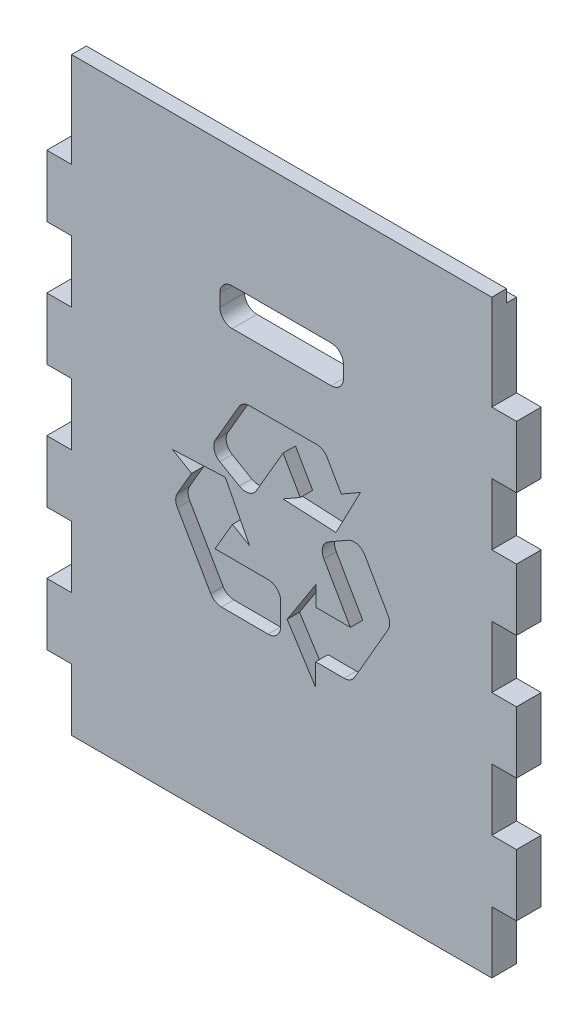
from build123d import *

# Parameters (mm, degrees)
EXTRUDE1_DEPTH = 20
EXTRUDE2_DEPTH = 611.187676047
EXTRUDE3_DEPTH = 10
SKETCH4_W      = 340
SKETCH4_H      = 10
EXTRUDE4_DEPTH = 8


with BuildPart() as part:
    # Sketch1 → Extrude1 (new body)
    with BuildSketch(Plane.XY):
        Polygon((0, 50), (20, 50), (20, 0), (360, 0), (360, 50), (380, 50), (380, 100), (360, 100), (360, 150), (380, 150), (380, 200), (360, 200), (360, 250), (380, 250), (380, 300), (360, 300), (360, 350), (380, 350), (380, 400), (360, 400), (360, 477), (20, 477), (20, 400), (0, 400), (0, 350), (20, 350), (20, 300), (0, 300), (0, 250), (20, 250), (20, 200), (0, 200), (0, 150), (20, 150), (20, 100), (0, 100), align=None)
    extrude(amount=EXTRUDE1_DEPTH)

    # Sketch2 → Extrude2 (cut, through all)
    with BuildSketch(Plane.XY.offset(20)):
        with BuildLine():
            Line((150, 380), (230, 380))
            ThreePointArc((230, 380), (237.071067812, 377.071067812), (240, 370))
            Line((240, 370), (240, 360))
            ThreePointArc((240, 360), (237.071067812, 352.928932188), (230, 350))
            Line((230, 350), (150, 350))
            ThreePointArc((150, 350), (142.928932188, 352.928932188), (140, 360))
            Line((140, 360), (140, 370))
            ThreePointArc((140, 370), (142.928932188, 377.071067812), (150, 380))
        make_face()
    extrude(amount=-EXTRUDE2_DEPTH, mode=Mode.SUBTRACT)

    # Sketch3 → Extrude3 (cut)
    with BuildSketch(Plane.XY.offset(20)):
        with BuildLine():
            Line((164.11707753, 303.028192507), (218.213802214, 303.028192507))
            ThreePointArc((218.213802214, 303.028192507), (223.228306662, 301.680056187), (226.890763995, 297.999141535))
            Line((226.890763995, 297.999141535), (238.231946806, 278.202718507))
            Line((238.231946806, 278.202718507), (253.787861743, 287.114554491))
            Line((253.787861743, 287.114554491), (233.97327242, 249.093892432))
            Line((233.97327242, 249.093892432), (191.152482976, 251.231340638))
            Line((191.152482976, 251.231340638), (205.052520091, 259.194539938))
            Line((205.052520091, 259.194539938), (191.185507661, 283.399885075))
            Line((191.185507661, 283.399885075), (169.517495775, 246.158574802))
            ThreePointArc((169.517495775, 246.158574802), (163.429851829, 241.51969186), (155.845051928, 242.544120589))
            Line((155.845051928, 242.544120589), (140.08067111, 251.716268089))
            ThreePointArc((140.08067111, 251.716268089), (135.441788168, 257.803912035), (136.466216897, 265.388711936))
            Line((136.466216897, 265.388711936), (155.4736285, 298.057187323))
            ThreePointArc((155.4736285, 298.057187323), (159.131596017, 301.696812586), (164.11707753, 303.028192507))
        make_face()
        with BuildLine():
            Line((194.471765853, 168.557979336), (217.73324502, 204.573146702))
            Line((217.73324502, 204.573146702), (217.679559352, 188.553761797))
            Line((217.679559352, 188.553761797), (245.575509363, 188.460274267))
            Line((245.575509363, 188.460274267), (224.15759454, 225.845978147))
            ThreePointArc((224.15759454, 225.845978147), (223.184026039, 233.437473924), (227.863607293, 239.493888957))
            Line((227.863607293, 239.493888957), (243.689110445, 248.56016947))
            ThreePointArc((243.689110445, 248.56016947), (251.280606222, 249.533737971), (257.337021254, 244.854156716))
            Line((257.337021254, 244.854156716), (276.125045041, 212.059017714))
            ThreePointArc((276.125045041, 212.059017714), (277.448069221, 207.071312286), (276.108337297, 202.088068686))
            Line((276.108337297, 202.088068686), (249.059974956, 155.238930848))
            ThreePointArc((249.059974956, 155.238930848), (245.385202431, 151.570310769), (240.366208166, 150.238987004))
            Line((240.366208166, 150.238987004), (217.551411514, 150.315446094))
            Line((217.551411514, 150.315446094), (217.491330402, 132.387710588))
            Line((217.491330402, 132.387710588), (194.471765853, 168.557979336))
        make_face()
        with BuildLine():
            Line((144.476372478, 243.03524406), (164.035682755, 204.882628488))
            Line((164.035682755, 204.882628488), (150.189331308, 212.938814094))
            Line((150.189331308, 212.938814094), (136.160393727, 188.826956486))
            Line((136.160393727, 188.826956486), (179.246320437, 188.682562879))
            ThreePointArc((179.246320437, 188.682562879), (186.307532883, 185.729950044), (189.21275153, 178.649106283))
            Line((189.21275153, 178.649106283), (189.151629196, 160.410678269))
            ThreePointArc((189.151629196, 160.410678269), (186.199016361, 153.349465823), (179.1181726, 150.444247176))
            Line((179.1181726, 150.444247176), (141.32273721, 150.570910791))
            ThreePointArc((141.32273721, 150.570910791), (136.341745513, 151.918990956), (132.695995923, 155.570854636))
            Line((132.695995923, 155.570854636), (105.647633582, 202.419992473))
            ThreePointArc((105.647633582, 202.419992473), (104.307901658, 207.436748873), (105.664438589, 212.44898729))
            Line((105.664438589, 212.44898729), (117.13805243, 232.168951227))
            Line((117.13805243, 232.168951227), (101.642218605, 241.18485075))
            Line((101.642218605, 241.18485075), (144.476372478, 243.03524406))
        make_face()
    extrude(amount=-EXTRUDE3_DEPTH, mode=Mode.SUBTRACT)

    # Sketch4 → Extrude4 (cut)
    with BuildSketch(Plane(origin=(0, 0, 0), x_dir=(-1, 0, 0), z_dir=(0, 0, -1))):
        with Locations((-190, 472)):
            Rectangle(SKETCH4_W, SKETCH4_H)
    extrude(amount=-EXTRUDE4_DEPTH, mode=Mode.SUBTRACT)


solid = part.part
